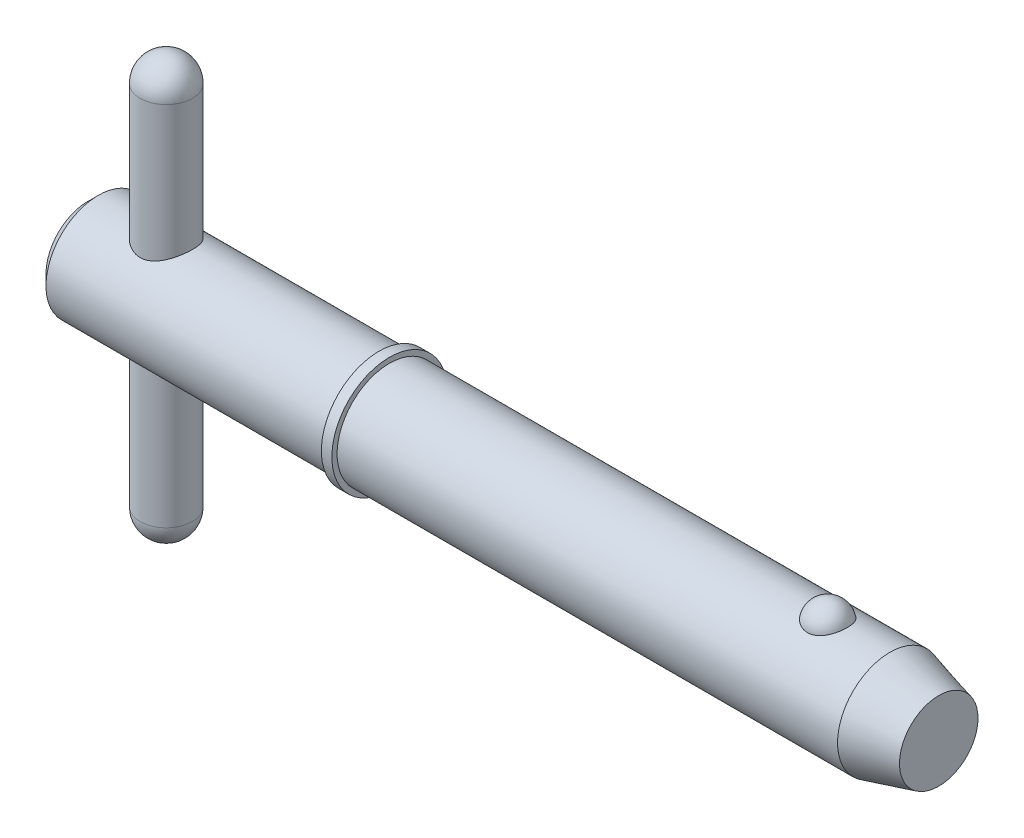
ISO-10303-21;
HEADER;
FILE_DESCRIPTION(('STEP AP214'),'2;1');
FILE_NAME('part.step','',(''),(''),'','','');
FILE_SCHEMA(('AUTOMOTIVE_DESIGN { 1 0 10303 214 1 1 1 1 }'));
ENDSEC;
DATA;
#1=APPLICATION_CONTEXT('core data for automotive mechanical design processes');
#2=APPLICATION_PROTOCOL_DEFINITION('international standard','automotive_design',2000,#1);
#3=PRODUCT_CONTEXT('',#1,'mechanical');
#4=PRODUCT('Part','Part','',(#3));
#5=PRODUCT_RELATED_PRODUCT_CATEGORY('part','',(#4));
#6=PRODUCT_DEFINITION_FORMATION('','',#4);
#7=PRODUCT_DEFINITION_CONTEXT('part definition',#1,'design');
#8=PRODUCT_DEFINITION('design','',#6,#7);
#9=PRODUCT_DEFINITION_SHAPE('','',#8);
#10=(LENGTH_UNIT() NAMED_UNIT(*) SI_UNIT(.MILLI.,.METRE.));
#11=(NAMED_UNIT(*) PLANE_ANGLE_UNIT() SI_UNIT($,.RADIAN.));
#12=(NAMED_UNIT(*) SI_UNIT($,.STERADIAN.) SOLID_ANGLE_UNIT());
#13=UNCERTAINTY_MEASURE_WITH_UNIT(LENGTH_MEASURE(1.E-05),#10,'distance_accuracy_value','');
#14=(GEOMETRIC_REPRESENTATION_CONTEXT(3) GLOBAL_UNCERTAINTY_ASSIGNED_CONTEXT((#13)) GLOBAL_UNIT_ASSIGNED_CONTEXT((#10,
#11,#12)) REPRESENTATION_CONTEXT('',''));
#15=CARTESIAN_POINT('',(0.,0.,0.));
#16=DIRECTION('',(0.,0.,1.));
#17=DIRECTION('',(1.,0.,0.));
#18=AXIS2_PLACEMENT_3D('',#15,#16,#17);
#19=CARTESIAN_POINT('',(4.755,12.7,0.));
#20=DIRECTION('',(0.,-1.,0.));
#21=DIRECTION('',(0.,0.,-1.));
#22=AXIS2_PLACEMENT_3D('',#19,#20,#21);
#23=CYLINDRICAL_SURFACE('',#22,1.585);
#24=CARTESIAN_POINT('',(4.755,-11.115,0.));
#25=DIRECTION('',(0.,-1.,0.));
#26=DIRECTION('',(0.,0.,-1.));
#27=AXIS2_PLACEMENT_3D('',#24,#25,#26);
#28=CIRCLE('',#27,1.585);
#29=CARTESIAN_POINT('',(4.755,-11.115,-1.585));
#30=VERTEX_POINT('',#29);
#31=EDGE_CURVE('P0_E10',#30,#30,#28,.F.);
#32=ORIENTED_EDGE('',*,*,#31,.T.);
#33=EDGE_LOOP('',(#32));
#34=FACE_BOUND('',#33,.T.);
#35=CARTESIAN_POINT('',(4.755,11.115,0.));
#36=DIRECTION('',(0.,-1.,0.));
#37=DIRECTION('',(0.,0.,-1.));
#38=AXIS2_PLACEMENT_3D('',#35,#36,#37);
#39=CIRCLE('',#38,1.585);
#40=CARTESIAN_POINT('',(4.755,11.115,-1.585));
#41=VERTEX_POINT('',#40);
#42=EDGE_CURVE('P0_E21',#41,#41,#39,.T.);
#43=ORIENTED_EDGE('',*,*,#42,.T.);
#44=EDGE_LOOP('',(#43));
#45=FACE_BOUND('',#44,.T.);
#46=ADVANCED_FACE('P0_F14',(#34,#45),#23,.T.);
#47=CARTESIAN_POINT('',(4.755,-11.115,0.));
#48=DIRECTION('',(0.,0.,1.));
#49=DIRECTION('',(1.,0.,0.));
#50=AXIS2_PLACEMENT_3D('',#47,#48,#49);
#51=SPHERICAL_SURFACE('',#50,1.585);
#52=CARTESIAN_POINT('',(4.755,-11.115,0.));
#53=DIRECTION('',(0.,-1.,0.));
#54=DIRECTION('',(0.,0.,-1.));
#55=AXIS2_PLACEMENT_3D('',#52,#53,#54);
#56=SPHERICAL_SURFACE('',#55,1.585);
#57=ORIENTED_EDGE('',*,*,#31,.F.);
#58=EDGE_LOOP('',(#57));
#59=FACE_BOUND('',#58,.T.);
#60=ADVANCED_FACE('P0_F29',(#59),#56,.T.);
#61=CARTESIAN_POINT('',(4.755,11.115,0.));
#62=DIRECTION('',(0.,0.,1.));
#63=DIRECTION('',(1.,0.,0.));
#64=AXIS2_PLACEMENT_3D('',#61,#62,#63);
#65=SPHERICAL_SURFACE('',#64,1.585);
#66=CARTESIAN_POINT('',(4.755,11.115,0.));
#67=DIRECTION('',(0.,-1.,0.));
#68=DIRECTION('',(0.,0.,-1.));
#69=AXIS2_PLACEMENT_3D('',#66,#67,#68);
#70=SPHERICAL_SURFACE('',#69,1.585);
#71=ORIENTED_EDGE('',*,*,#42,.F.);
#72=EDGE_LOOP('',(#71));
#73=FACE_BOUND('',#72,.T.);
#74=ADVANCED_FACE('P0_F16',(#73),#70,.T.);
#75=CLOSED_SHELL('',(#46,#60,#74));
#76=MANIFOLD_SOLID_BREP('P0_B1',#75);
#77=CARTESIAN_POINT('',(0.,0.,0.));
#78=DIRECTION('',(1.,0.,0.));
#79=DIRECTION('',(0.,0.,-1.));
#80=AXIS2_PLACEMENT_3D('',#77,#78,#79);
#81=CYLINDRICAL_SURFACE('',#80,3.175);
#82=CARTESIAN_POINT('',(48.6476846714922,0.,0.));
#83=DIRECTION('',(1.,0.,0.));
#84=DIRECTION('',(0.,0.,-1.));
#85=AXIS2_PLACEMENT_3D('',#82,#83,#84);
#86=CIRCLE('',#85,3.175);
#87=CARTESIAN_POINT('',(48.6476846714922,0.,-3.175));
#88=VERTEX_POINT('',#87);
#89=EDGE_CURVE('P1_E81',#88,#88,#86,.T.);
#90=ORIENTED_EDGE('',*,*,#89,.F.);
#91=EDGE_LOOP('',(#90));
#92=FACE_BOUND('',#91,.T.);
#93=CARTESIAN_POINT('',(18.29,0.,0.));
#94=DIRECTION('',(1.,0.,0.));
#95=DIRECTION('',(0.,0.,-1.));
#96=AXIS2_PLACEMENT_3D('',#93,#94,#95);
#97=CIRCLE('',#96,3.175);
#98=CARTESIAN_POINT('',(18.29,0.,-3.175));
#99=VERTEX_POINT('',#98);
#100=EDGE_CURVE('P1_E85',#99,#99,#97,.T.);
#101=ORIENTED_EDGE('',*,*,#100,.T.);
#102=EDGE_LOOP('',(#101));
#103=FACE_BOUND('',#102,.T.);
#104=CARTESIAN_POINT('',(44.8757276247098,2.92898950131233,1.2254164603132));
#105=CARTESIAN_POINT('',(44.812316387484,2.92899434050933,1.22541146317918));
#106=CARTESIAN_POINT('',(44.7487979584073,2.93112688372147,1.2203464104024));
#107=CARTESIAN_POINT('',(44.6235306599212,2.93942752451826,1.20020949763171));
#108=CARTESIAN_POINT('',(44.5617869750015,2.9456063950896,1.18511092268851));
#109=CARTESIAN_POINT('',(44.4420651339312,2.96127115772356,1.14540352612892));
#110=CARTESIAN_POINT('',(44.3840775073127,2.97074831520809,1.12081980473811));
#111=CARTESIAN_POINT('',(44.2731943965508,2.99197584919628,1.06285154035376));
#112=CARTESIAN_POINT('',(44.2202966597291,3.0037252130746,1.02947091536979));
#113=CARTESIAN_POINT('',(44.1192688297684,3.02865714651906,0.95367409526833));
#114=CARTESIAN_POINT('',(44.071324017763,3.04187163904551,0.911021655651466));
#115=CARTESIAN_POINT('',(43.9830360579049,3.06808741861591,0.818400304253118));
#116=CARTESIAN_POINT('',(43.9426952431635,3.08108863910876,0.768429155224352));
#117=CARTESIAN_POINT('',(43.8688039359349,3.10614903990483,0.6600648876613));
#118=CARTESIAN_POINT('',(43.8356330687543,3.11814104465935,0.601396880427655));
#119=CARTESIAN_POINT('',(43.7791190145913,3.13926931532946,0.479026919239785));
#120=CARTESIAN_POINT('',(43.7557764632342,3.14840539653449,0.415324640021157));
#121=CARTESIAN_POINT('',(43.7191785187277,3.16298160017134,0.283885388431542));
#122=CARTESIAN_POINT('',(43.7060407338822,3.16837855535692,0.216110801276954));
#123=CARTESIAN_POINT('',(43.6905676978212,3.17475386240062,0.0791367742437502));
#124=CARTESIAN_POINT('',(43.688232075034,3.17573236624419,0.00993738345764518));
#125=CARTESIAN_POINT('',(43.694388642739,3.17318075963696,-0.127420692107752));
#126=CARTESIAN_POINT('',(43.7028073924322,3.16968122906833,-0.195583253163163));
#127=CARTESIAN_POINT('',(43.7301752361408,3.1585790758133,-0.329413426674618));
#128=CARTESIAN_POINT('',(43.7491245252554,3.15097637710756,-0.395080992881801));
#129=CARTESIAN_POINT('',(43.7972057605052,3.13242485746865,-0.522180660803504));
#130=CARTESIAN_POINT('',(43.8263524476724,3.12147119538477,-0.583606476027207));
#131=CARTESIAN_POINT('',(43.8942352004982,3.09734973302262,-0.700436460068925));
#132=CARTESIAN_POINT('',(43.932972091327,3.08418174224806,-0.7558401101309));
#133=CARTESIAN_POINT('',(44.0194771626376,3.05694884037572,-0.859404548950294));
#134=CARTESIAN_POINT('',(44.0672961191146,3.04287919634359,-0.907521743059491));
#135=CARTESIAN_POINT('',(44.1707353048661,3.01548927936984,-0.994758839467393));
#136=CARTESIAN_POINT('',(44.2263549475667,3.00216895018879,-1.03387941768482));
#137=CARTESIAN_POINT('',(44.3428093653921,2.97810316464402,-1.10126594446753));
#138=CARTESIAN_POINT('',(44.4035182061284,2.96731170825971,-1.12973256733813));
#139=CARTESIAN_POINT('',(44.5293712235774,2.9492893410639,-1.17598467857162));
#140=CARTESIAN_POINT('',(44.5945137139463,2.94205708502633,-1.19377420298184));
#141=CARTESIAN_POINT('',(44.7238562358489,2.93233065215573,-1.21746387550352));
#142=CARTESIAN_POINT('',(44.7879385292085,2.92961621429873,-1.22391763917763));
#143=CARTESIAN_POINT('',(44.9163375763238,2.92855752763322,-1.22644976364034));
#144=CARTESIAN_POINT('',(44.980654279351,2.93021238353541,-1.22253024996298));
#145=CARTESIAN_POINT('',(45.1055239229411,2.9375685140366,-1.20474140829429));
#146=CARTESIAN_POINT('',(45.166131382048,2.94313790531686,-1.19119621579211));
#147=CARTESIAN_POINT('',(45.2841106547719,2.95756226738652,-1.15491492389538));
#148=CARTESIAN_POINT('',(45.3414822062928,2.96641750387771,-1.13217808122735));
#149=CARTESIAN_POINT('',(45.4527699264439,2.98669918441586,-1.07755083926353));
#150=CARTESIAN_POINT('',(45.5065845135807,2.9981771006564,-1.0454730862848));
#151=CARTESIAN_POINT('',(45.6081473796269,3.02240235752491,-0.973220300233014));
#152=CARTESIAN_POINT('',(45.6558942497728,3.03514999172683,-0.933043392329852));
#153=CARTESIAN_POINT('',(45.7465817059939,3.06131230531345,-0.843372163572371));
#154=CARTESIAN_POINT('',(45.7891588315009,3.07472822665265,-0.793510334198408));
#155=CARTESIAN_POINT('',(45.8656765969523,3.10021106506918,-0.687241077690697));
#156=CARTESIAN_POINT('',(45.8996156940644,3.1122777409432,-0.630832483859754));
#157=CARTESIAN_POINT('',(45.9591209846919,3.134208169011,-0.511059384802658));
#158=CARTESIAN_POINT('',(45.9843892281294,3.14399040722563,-0.447531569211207));
#159=CARTESIAN_POINT('',(46.0245117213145,3.15983820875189,-0.316827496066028));
#160=CARTESIAN_POINT('',(46.0393659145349,3.16590375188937,-0.249651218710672));
#161=CARTESIAN_POINT('',(46.058358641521,3.17370076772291,-0.11354918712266));
#162=CARTESIAN_POINT('',(46.0624966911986,3.17543204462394,-0.0446233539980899));
#163=CARTESIAN_POINT('',(46.0599697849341,3.17438372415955,0.0929938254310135));
#164=CARTESIAN_POINT('',(46.0533050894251,3.17160423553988,0.161685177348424));
#165=CARTESIAN_POINT('',(46.0293754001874,3.1618438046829,0.296502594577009));
#166=CARTESIAN_POINT('',(46.0121674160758,3.15488546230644,0.362640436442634));
#167=CARTESIAN_POINT('',(45.967547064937,3.13748892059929,0.490896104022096));
#168=CARTESIAN_POINT('',(45.9401339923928,3.12705048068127,0.553013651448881));
#169=CARTESIAN_POINT('',(45.8754626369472,3.10369139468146,0.671876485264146));
#170=CARTESIAN_POINT('',(45.8381467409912,3.0907563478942,0.728587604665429));
#171=CARTESIAN_POINT('',(45.7545246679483,3.06381731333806,0.834653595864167));
#172=CARTESIAN_POINT('',(45.7082189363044,3.04981337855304,0.884008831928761));
#173=CARTESIAN_POINT('',(45.6077184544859,3.02230423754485,0.973916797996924));
#174=CARTESIAN_POINT('',(45.553535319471,3.00879833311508,1.01448227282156));
#175=CARTESIAN_POINT('',(45.4385299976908,2.98383625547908,1.0857155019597));
#176=CARTESIAN_POINT('',(45.3777053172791,2.9723808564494,1.11637952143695));
#177=CARTESIAN_POINT('',(45.2533690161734,2.95329063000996,1.16592590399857));
#178=CARTESIAN_POINT('',(45.1900230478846,2.9455373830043,1.18517901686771));
#179=CARTESIAN_POINT('',(45.0607664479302,2.9342556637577,1.21284802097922));
#180=CARTESIAN_POINT('',(44.9948641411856,2.93071450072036,1.2212964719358));
#181=CARTESIAN_POINT('',(44.911116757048,2.9291525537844,1.22502505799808));
#182=CARTESIAN_POINT('',(44.8934263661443,2.92898815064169,1.22541785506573));
#183=CARTESIAN_POINT('',(44.8757276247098,2.92898950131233,1.2254164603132));
#184=B_SPLINE_CURVE_WITH_KNOTS('',3,(#104,#105,#106,#107,#108,#109,#110,#111,#112,#113,#114,
#115,#116,#117,#118,#119,#120,#121,#122,#123,#124,#125,#126,#127,#128,#129,#130,#131,#132,#133,
#134,#135,#136,#137,#138,#139,#140,#141,#142,#143,#144,#145,#146,#147,#148,#149,#150,#151,#152,
#153,#154,#155,#156,#157,#158,#159,#160,#161,#162,#163,#164,#165,#166,#167,#168,#169,#170,#171,
#172,#173,#174,#175,#176,#177,#178,#179,#180,#181,#182,#183),.UNSPECIFIED.,.T.,.F.,(4,2,2,2,2,2,
2,2,2,2,2,2,2,2,2,2,2,2,2,2,2,2,2,2,2,2,2,2,2,2,2,2,2,2,2,2,2,2,2,4),(0.,0.190186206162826,
0.380880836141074,0.571074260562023,0.761183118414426,0.956866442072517,1.15260970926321,
1.35701770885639,1.56143892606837,1.76818248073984,1.97491892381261,2.18025109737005,
2.38558707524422,2.59122111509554,2.79687285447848,3.00371012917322,3.2105318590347,
3.41323429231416,3.61586005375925,3.80828192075,4.00066436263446,4.18685798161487,
4.37306665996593,4.56330302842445,4.75358348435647,4.95345287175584,5.15335793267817,
5.35957003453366,5.56578325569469,5.77200579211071,5.97822335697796,6.183335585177,
6.38846199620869,6.59480900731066,6.80114579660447,7.00718137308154,7.21329457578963,
7.41228022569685,7.61066481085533,7.66374777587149),.UNSPECIFIED.);
#185=CARTESIAN_POINT('',(44.8757276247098,2.92898950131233,1.2254164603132));
#186=VERTEX_POINT('',#185);
#187=EDGE_CURVE('P1_E35',#186,#186,#184,.T.);
#188=ORIENTED_EDGE('',*,*,#187,.T.);
#189=EDGE_LOOP('',(#188));
#190=FACE_BOUND('',#189,.T.);
#191=ADVANCED_FACE('P1_F13',(#92,#103,#190),#81,.T.);
#192=CARTESIAN_POINT('',(0.,0.,0.));
#193=DIRECTION('',(-1.,0.,0.));
#194=DIRECTION('',(0.,0.,1.));
#195=AXIS2_PLACEMENT_3D('',#192,#193,#194);
#196=PLANE('',#195);
#197=CARTESIAN_POINT('',(0.,0.,0.));
#198=DIRECTION('',(1.,0.,0.));
#199=DIRECTION('',(0.,0.,-1.));
#200=AXIS2_PLACEMENT_3D('',#197,#198,#199);
#201=CIRCLE('',#200,2.54);
#202=CARTESIAN_POINT('',(0.,0.,-2.54));
#203=VERTEX_POINT('',#202);
#204=EDGE_CURVE('P1_E9',#203,#203,#201,.T.);
#205=ORIENTED_EDGE('',*,*,#204,.F.);
#206=EDGE_LOOP('',(#205));
#207=FACE_BOUND('',#206,.T.);
#208=ADVANCED_FACE('P1_F15',(#207),#196,.T.);
#209=CARTESIAN_POINT('',(0.634999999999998,0.,0.));
#210=DIRECTION('',(1.,0.,0.));
#211=DIRECTION('',(0.,0.,-1.));
#212=AXIS2_PLACEMENT_3D('',#209,#210,#211);
#213=CONICAL_SURFACE('',#212,3.175,0.78539816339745);
#214=ORIENTED_EDGE('',*,*,#204,.T.);
#215=EDGE_LOOP('',(#214));
#216=FACE_BOUND('',#215,.T.);
#217=CARTESIAN_POINT('',(0.634999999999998,0.,0.));
#218=DIRECTION('',(1.,0.,0.));
#219=DIRECTION('',(0.,0.,-1.));
#220=AXIS2_PLACEMENT_3D('',#217,#218,#219);
#221=CIRCLE('',#220,3.175);
#222=CARTESIAN_POINT('',(0.634999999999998,0.,-3.175));
#223=VERTEX_POINT('',#222);
#224=EDGE_CURVE('P1_E26',#223,#223,#221,.T.);
#225=ORIENTED_EDGE('',*,*,#224,.F.);
#226=EDGE_LOOP('',(#225));
#227=FACE_BOUND('',#226,.T.);
#228=ADVANCED_FACE('P1_F77',(#216,#227),#213,.T.);
#229=CARTESIAN_POINT('',(0.,0.,0.));
#230=DIRECTION('',(1.,0.,0.));
#231=DIRECTION('',(0.,0.,-1.));
#232=AXIS2_PLACEMENT_3D('',#229,#230,#231);
#233=CYLINDRICAL_SURFACE('',#232,3.175);
#234=CARTESIAN_POINT('',(4.755,-2.75107251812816,1.585));
#235=CARTESIAN_POINT('',(4.67238891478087,-2.7510796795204,1.58499425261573));
#236=CARTESIAN_POINT('',(4.58967306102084,-2.75485010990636,1.57849830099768));
#237=CARTESIAN_POINT('',(4.42677850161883,-2.76938647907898,1.55284486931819));
#238=CARTESIAN_POINT('',(4.34660551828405,-2.78016716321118,1.53366069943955));
#239=CARTESIAN_POINT('',(4.19146029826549,-2.80716278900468,1.48366329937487));
#240=CARTESIAN_POINT('',(4.11646293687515,-2.8233488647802,1.45291173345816));
#241=CARTESIAN_POINT('',(3.97271079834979,-2.85928672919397,1.38084067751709));
#242=CARTESIAN_POINT('',(3.90395634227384,-2.87903870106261,1.33952064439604));
#243=CARTESIAN_POINT('',(3.76839976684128,-2.921867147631,1.24350234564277));
#244=CARTESIAN_POINT('',(3.702222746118,-2.94508343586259,1.18798355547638));
#245=CARTESIAN_POINT('',(3.5796334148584,-2.99109588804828,1.06685014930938));
#246=CARTESIAN_POINT('',(3.52322596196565,-3.01389183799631,1.00123054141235));
#247=CARTESIAN_POINT('',(3.41807024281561,-3.05832598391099,0.856373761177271));
#248=CARTESIAN_POINT('',(3.37009053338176,-3.07978367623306,0.776518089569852));
#249=CARTESIAN_POINT('',(3.28853137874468,-3.11730894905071,0.608596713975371));
#250=CARTESIAN_POINT('',(3.25494287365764,-3.1333799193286,0.520536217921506));
#251=CARTESIAN_POINT('',(3.20559401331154,-3.15731341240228,0.345327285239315));
#252=CARTESIAN_POINT('',(3.18873760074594,-3.16567752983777,0.258557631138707));
#253=CARTESIAN_POINT('',(3.16972238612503,-3.17512718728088,0.0830496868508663));
#254=CARTESIAN_POINT('',(3.16755472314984,-3.17621711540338,-0.00568738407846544));
#255=CARTESIAN_POINT('',(3.1775542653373,-3.17123385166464,-0.174372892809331));
#256=CARTESIAN_POINT('',(3.18849502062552,-3.16577346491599,-0.254416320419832));
#257=CARTESIAN_POINT('',(3.22220680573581,-3.14922844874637,-0.411354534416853));
#258=CARTESIAN_POINT('',(3.2449787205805,-3.13814339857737,-0.488249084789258));
#259=CARTESIAN_POINT('',(3.30185558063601,-3.111172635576,-0.638050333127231));
#260=CARTESIAN_POINT('',(3.33611332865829,-3.09522247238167,-0.710886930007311));
#261=CARTESIAN_POINT('',(3.41477890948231,-3.05996035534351,-0.849953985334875));
#262=CARTESIAN_POINT('',(3.45919037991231,-3.04064719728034,-0.916182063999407));
#263=CARTESIAN_POINT('',(3.5617148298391,-2.99832415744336,-1.04681642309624));
#264=CARTESIAN_POINT('',(3.62072497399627,-2.97513741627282,-1.11046186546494));
#265=CARTESIAN_POINT('',(3.7483697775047,-2.92885066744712,-1.22736291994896));
#266=CARTESIAN_POINT('',(3.81701173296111,-2.90575073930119,-1.2806105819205));
#267=CARTESIAN_POINT('',(3.96727993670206,-2.86067370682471,-1.37849835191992));
#268=CARTESIAN_POINT('',(4.04945242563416,-2.83885964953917,-1.42238246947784));
#269=CARTESIAN_POINT('',(4.2213558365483,-2.80110454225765,-1.49537418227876));
#270=CARTESIAN_POINT('',(4.3110787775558,-2.78515738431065,-1.52449715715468));
#271=CARTESIAN_POINT('',(4.48806324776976,-2.76271292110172,-1.56478065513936));
#272=CARTESIAN_POINT('',(4.57495732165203,-2.75556745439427,-1.57718067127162));
#273=CARTESIAN_POINT('',(4.74985771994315,-2.74969306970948,-1.58740564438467));
#274=CARTESIAN_POINT('',(4.8378632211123,-2.75095824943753,-1.58524082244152));
#275=CARTESIAN_POINT('',(5.00227282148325,-2.76107477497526,-1.56753530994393));
#276=CARTESIAN_POINT('',(5.07889680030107,-2.76908515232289,-1.55347662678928));
#277=CARTESIAN_POINT('',(5.22855309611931,-2.79054849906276,-1.51458035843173));
#278=CARTESIAN_POINT('',(5.30158424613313,-2.80400322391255,-1.489739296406));
#279=CARTESIAN_POINT('',(5.44583114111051,-2.83556995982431,-1.42877335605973));
#280=CARTESIAN_POINT('',(5.51680600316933,-2.85386886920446,-1.39217900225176));
#281=CARTESIAN_POINT('',(5.6520174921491,-2.89289503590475,-1.30915485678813));
#282=CARTESIAN_POINT('',(5.71625063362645,-2.91362353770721,-1.26272001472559));
#283=CARTESIAN_POINT('',(5.8445938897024,-2.95830220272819,-1.15451693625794));
#284=CARTESIAN_POINT('',(5.90767560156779,-2.98233004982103,-1.09155543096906));
#285=CARTESIAN_POINT('',(6.0226995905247,-3.02864458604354,-0.955560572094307));
#286=CARTESIAN_POINT('',(6.07463814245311,-3.05093069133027,-0.882523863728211));
#287=CARTESIAN_POINT('',(6.16704288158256,-3.09200671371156,-0.725836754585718));
#288=CARTESIAN_POINT('',(6.20717458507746,-3.11069030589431,-0.64195924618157));
#289=CARTESIAN_POINT('',(6.27235859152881,-3.1416474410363,-0.467442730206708));
#290=CARTESIAN_POINT('',(6.29742409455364,-3.15392659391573,-0.376809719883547));
#291=CARTESIAN_POINT('',(6.32960989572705,-3.16979844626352,-0.200314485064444));
#292=CARTESIAN_POINT('',(6.33816324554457,-3.17408359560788,-0.114775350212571));
#293=CARTESIAN_POINT('',(6.34130309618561,-3.17565001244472,0.0566108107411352));
#294=CARTESIAN_POINT('',(6.33589445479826,-3.17293371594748,0.142457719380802));
#295=CARTESIAN_POINT('',(6.31221457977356,-3.16120608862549,0.306097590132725));
#296=CARTESIAN_POINT('',(6.2948097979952,-3.15261910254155,0.38404960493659));
#297=CARTESIAN_POINT('',(6.24879775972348,-3.13040364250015,0.535801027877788));
#298=CARTESIAN_POINT('',(6.22018889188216,-3.11677444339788,0.609599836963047));
#299=CARTESIAN_POINT('',(6.15130303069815,-3.08497808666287,0.754502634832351));
#300=CARTESIAN_POINT('',(6.11057850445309,-3.0666414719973,0.82535556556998));
#301=CARTESIAN_POINT('',(6.01917980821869,-3.02735012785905,0.95951596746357));
#302=CARTESIAN_POINT('',(5.96850106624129,-3.00639419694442,1.02281994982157));
#303=CARTESIAN_POINT('',(5.8528006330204,-2.96149402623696,1.1467073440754));
#304=CARTESIAN_POINT('',(5.78685463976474,-2.93745961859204,1.20639723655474));
#305=CARTESIAN_POINT('',(5.64552278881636,-2.89084502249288,1.31419099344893));
#306=CARTESIAN_POINT('',(5.57012871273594,-2.8682661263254,1.36228466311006));
#307=CARTESIAN_POINT('',(5.40892145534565,-2.82661780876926,1.44677201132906));
#308=CARTESIAN_POINT('',(5.32285703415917,-2.80767948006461,1.48275497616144));
#309=CARTESIAN_POINT('',(5.14469010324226,-2.77716572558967,1.53916557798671));
#310=CARTESIAN_POINT('',(5.05260892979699,-2.76556569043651,1.55964525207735));
#311=CARTESIAN_POINT('',(4.92544162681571,-2.75613775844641,1.57618070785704));
#312=CARTESIAN_POINT('',(4.89147210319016,-2.75424493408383,1.57948285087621));
#313=CARTESIAN_POINT('',(4.82334103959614,-2.75171079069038,1.58389375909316));
#314=CARTESIAN_POINT('',(4.78917948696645,-2.75106955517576,1.58500237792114));
#315=CARTESIAN_POINT('',(4.755,-2.75107251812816,1.585));
#316=B_SPLINE_CURVE_WITH_KNOTS('',3,(#234,#235,#236,#237,#238,#239,#240,#241,#242,#243,#244,
#245,#246,#247,#248,#249,#250,#251,#252,#253,#254,#255,#256,#257,#258,#259,#260,#261,#262,#263,
#264,#265,#266,#267,#268,#269,#270,#271,#272,#273,#274,#275,#276,#277,#278,#279,#280,#281,#282,
#283,#284,#285,#286,#287,#288,#289,#290,#291,#292,#293,#294,#295,#296,#297,#298,#299,#300,#301,
#302,#303,#304,#305,#306,#307,#308,#309,#310,#311,#312,#313,#314,#315),.UNSPECIFIED.,.T.,.F.,(4,
2,2,2,2,2,2,2,2,2,2,2,2,2,2,2,2,2,2,2,2,2,2,2,2,2,2,2,2,2,2,2,2,2,2,2,2,2,2,2,4),(0.,
0.247689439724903,0.495901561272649,0.742808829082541,0.989728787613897,1.25694656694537,
1.52429683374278,1.80959781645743,2.0947189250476,2.35960564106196,2.62433255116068,
2.86610932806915,3.1079041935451,3.35305262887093,3.59828902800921,3.86665310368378,
4.13522157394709,4.4207514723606,4.70598326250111,4.9686344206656,5.23110127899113,
5.46499114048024,5.69895647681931,5.94376186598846,6.1886932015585,6.46438263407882,
6.74016408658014,7.0231370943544,7.30586181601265,7.5626977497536,7.81944433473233,
8.05935987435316,8.29930993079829,8.54954401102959,8.79989329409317,9.07508848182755,
9.35052473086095,9.63453318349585,9.91758407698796,10.0200561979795,10.1225351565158),.UNSPECIFIED.);
#317=CARTESIAN_POINT('',(4.755,-2.75107251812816,1.585));
#318=VERTEX_POINT('',#317);
#319=EDGE_CURVE('P1_E17',#318,#318,#316,.T.);
#320=ORIENTED_EDGE('',*,*,#319,.F.);
#321=EDGE_LOOP('',(#320));
#322=FACE_BOUND('',#321,.T.);
#323=CARTESIAN_POINT('',(4.755,2.75107251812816,1.585));
#324=CARTESIAN_POINT('',(4.83761108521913,2.7510796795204,1.58499425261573));
#325=CARTESIAN_POINT('',(4.92032693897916,2.75485010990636,1.57849830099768));
#326=CARTESIAN_POINT('',(5.08322149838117,2.76938647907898,1.55284486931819));
#327=CARTESIAN_POINT('',(5.16339448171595,2.78016716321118,1.53366069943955));
#328=CARTESIAN_POINT('',(5.31853970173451,2.80716278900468,1.48366329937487));
#329=CARTESIAN_POINT('',(5.39353706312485,2.8233488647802,1.45291173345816));
#330=CARTESIAN_POINT('',(5.53728920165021,2.85928672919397,1.38084067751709));
#331=CARTESIAN_POINT('',(5.60604365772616,2.87903870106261,1.33952064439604));
#332=CARTESIAN_POINT('',(5.74160023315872,2.921867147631,1.24350234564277));
#333=CARTESIAN_POINT('',(5.807777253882,2.94508343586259,1.18798355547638));
#334=CARTESIAN_POINT('',(5.9303665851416,2.99109588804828,1.06685014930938));
#335=CARTESIAN_POINT('',(5.98677403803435,3.01389183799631,1.00123054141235));
#336=CARTESIAN_POINT('',(6.09192975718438,3.05832598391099,0.85637376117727));
#337=CARTESIAN_POINT('',(6.13990946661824,3.07978367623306,0.776518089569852));
#338=CARTESIAN_POINT('',(6.22146862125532,3.11730894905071,0.608596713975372));
#339=CARTESIAN_POINT('',(6.25505712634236,3.1333799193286,0.520536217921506));
#340=CARTESIAN_POINT('',(6.30440598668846,3.15731341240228,0.345327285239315));
#341=CARTESIAN_POINT('',(6.32126239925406,3.16567752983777,0.258557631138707));
#342=CARTESIAN_POINT('',(6.34027761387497,3.17512718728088,0.0830496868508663));
#343=CARTESIAN_POINT('',(6.34244527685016,3.17621711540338,-0.00568738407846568));
#344=CARTESIAN_POINT('',(6.3324457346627,3.17123385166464,-0.174372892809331));
#345=CARTESIAN_POINT('',(6.32150497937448,3.16577346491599,-0.254416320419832));
#346=CARTESIAN_POINT('',(6.28779319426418,3.14922844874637,-0.411354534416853));
#347=CARTESIAN_POINT('',(6.2650212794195,3.13814339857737,-0.488249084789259));
#348=CARTESIAN_POINT('',(6.20814441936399,3.111172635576,-0.638050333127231));
#349=CARTESIAN_POINT('',(6.17388667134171,3.09522247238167,-0.710886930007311));
#350=CARTESIAN_POINT('',(6.09522109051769,3.05996035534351,-0.849953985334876));
#351=CARTESIAN_POINT('',(6.05080962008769,3.04064719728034,-0.916182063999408));
#352=CARTESIAN_POINT('',(5.9482851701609,2.99832415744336,-1.04681642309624));
#353=CARTESIAN_POINT('',(5.88927502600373,2.97513741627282,-1.11046186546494));
#354=CARTESIAN_POINT('',(5.7616302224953,2.92885066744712,-1.22736291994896));
#355=CARTESIAN_POINT('',(5.69298826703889,2.90575073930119,-1.2806105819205));
#356=CARTESIAN_POINT('',(5.54272006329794,2.86067370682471,-1.37849835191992));
#357=CARTESIAN_POINT('',(5.46054757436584,2.83885964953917,-1.42238246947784));
#358=CARTESIAN_POINT('',(5.2886441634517,2.80110454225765,-1.49537418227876));
#359=CARTESIAN_POINT('',(5.19892122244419,2.78515738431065,-1.52449715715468));
#360=CARTESIAN_POINT('',(5.02193675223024,2.76271292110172,-1.56478065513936));
#361=CARTESIAN_POINT('',(4.93504267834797,2.75556745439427,-1.57718067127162));
#362=CARTESIAN_POINT('',(4.76014228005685,2.74969306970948,-1.58740564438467));
#363=CARTESIAN_POINT('',(4.6721367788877,2.75095824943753,-1.58524082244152));
#364=CARTESIAN_POINT('',(4.50772717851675,2.76107477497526,-1.56753530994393));
#365=CARTESIAN_POINT('',(4.43110319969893,2.76908515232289,-1.55347662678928));
#366=CARTESIAN_POINT('',(4.28144690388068,2.79054849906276,-1.51458035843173));
#367=CARTESIAN_POINT('',(4.20841575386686,2.80400322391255,-1.489739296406));
#368=CARTESIAN_POINT('',(4.06416885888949,2.83556995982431,-1.42877335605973));
#369=CARTESIAN_POINT('',(3.99319399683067,2.85386886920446,-1.39217900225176));
#370=CARTESIAN_POINT('',(3.8579825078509,2.89289503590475,-1.30915485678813));
#371=CARTESIAN_POINT('',(3.79374936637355,2.91362353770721,-1.26272001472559));
#372=CARTESIAN_POINT('',(3.6654061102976,2.95830220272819,-1.15451693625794));
#373=CARTESIAN_POINT('',(3.60232439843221,2.98233004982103,-1.09155543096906));
#374=CARTESIAN_POINT('',(3.4873004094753,3.02864458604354,-0.955560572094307));
#375=CARTESIAN_POINT('',(3.43536185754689,3.05093069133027,-0.88252386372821));
#376=CARTESIAN_POINT('',(3.34295711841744,3.09200671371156,-0.725836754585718));
#377=CARTESIAN_POINT('',(3.30282541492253,3.11069030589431,-0.64195924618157));
#378=CARTESIAN_POINT('',(3.23764140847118,3.14164744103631,-0.467442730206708));
#379=CARTESIAN_POINT('',(3.21257590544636,3.15392659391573,-0.376809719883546));
#380=CARTESIAN_POINT('',(3.18039010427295,3.16979844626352,-0.200314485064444));
#381=CARTESIAN_POINT('',(3.17183675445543,3.17408359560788,-0.114775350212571));
#382=CARTESIAN_POINT('',(3.16869690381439,3.17565001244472,0.0566108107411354));
#383=CARTESIAN_POINT('',(3.17410554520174,3.17293371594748,0.142457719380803));
#384=CARTESIAN_POINT('',(3.19778542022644,3.16120608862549,0.306097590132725));
#385=CARTESIAN_POINT('',(3.2151902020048,3.15261910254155,0.384049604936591));
#386=CARTESIAN_POINT('',(3.26120224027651,3.13040364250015,0.535801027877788));
#387=CARTESIAN_POINT('',(3.28981110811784,3.11677444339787,0.609599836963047));
#388=CARTESIAN_POINT('',(3.35869696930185,3.08497808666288,0.754502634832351));
#389=CARTESIAN_POINT('',(3.39942149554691,3.0666414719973,0.82535556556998));
#390=CARTESIAN_POINT('',(3.49082019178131,3.02735012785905,0.95951596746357));
#391=CARTESIAN_POINT('',(3.54149893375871,3.00639419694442,1.02281994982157));
#392=CARTESIAN_POINT('',(3.6571993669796,2.96149402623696,1.1467073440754));
#393=CARTESIAN_POINT('',(3.72314536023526,2.93745961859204,1.20639723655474));
#394=CARTESIAN_POINT('',(3.86447721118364,2.89084502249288,1.31419099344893));
#395=CARTESIAN_POINT('',(3.93987128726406,2.8682661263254,1.36228466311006));
#396=CARTESIAN_POINT('',(4.10107854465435,2.82661780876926,1.44677201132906));
#397=CARTESIAN_POINT('',(4.18714296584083,2.80767948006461,1.48275497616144));
#398=CARTESIAN_POINT('',(4.36530989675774,2.77716572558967,1.53916557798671));
#399=CARTESIAN_POINT('',(4.45739107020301,2.76556569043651,1.55964525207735));
#400=CARTESIAN_POINT('',(4.58455837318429,2.75613775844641,1.57618070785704));
#401=CARTESIAN_POINT('',(4.61852789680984,2.75424493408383,1.57948285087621));
#402=CARTESIAN_POINT('',(4.68665896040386,2.75171079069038,1.58389375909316));
#403=CARTESIAN_POINT('',(4.72082051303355,2.75106955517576,1.58500237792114));
#404=CARTESIAN_POINT('',(4.755,2.75107251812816,1.585));
#405=B_SPLINE_CURVE_WITH_KNOTS('',3,(#323,#324,#325,#326,#327,#328,#329,#330,#331,#332,#333,
#334,#335,#336,#337,#338,#339,#340,#341,#342,#343,#344,#345,#346,#347,#348,#349,#350,#351,#352,
#353,#354,#355,#356,#357,#358,#359,#360,#361,#362,#363,#364,#365,#366,#367,#368,#369,#370,#371,
#372,#373,#374,#375,#376,#377,#378,#379,#380,#381,#382,#383,#384,#385,#386,#387,#388,#389,#390,
#391,#392,#393,#394,#395,#396,#397,#398,#399,#400,#401,#402,#403,#404),.UNSPECIFIED.,.T.,.F.,(4,
2,2,2,2,2,2,2,2,2,2,2,2,2,2,2,2,2,2,2,2,2,2,2,2,2,2,2,2,2,2,2,2,2,2,2,2,2,2,2,4),(0.,
0.247689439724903,0.495901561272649,0.742808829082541,0.989728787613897,1.25694656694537,
1.52429683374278,1.80959781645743,2.0947189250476,2.35960564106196,2.62433255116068,
2.86610932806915,3.1079041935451,3.35305262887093,3.59828902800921,3.86665310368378,
4.13522157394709,4.4207514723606,4.70598326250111,4.9686344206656,5.23110127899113,
5.46499114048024,5.69895647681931,5.94376186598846,6.1886932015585,6.46438263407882,
6.74016408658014,7.0231370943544,7.30586181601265,7.5626977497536,7.81944433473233,
8.05935987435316,8.29930993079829,8.54954401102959,8.79989329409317,9.07508848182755,
9.35052473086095,9.63453318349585,9.91758407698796,10.0200561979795,10.1225351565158),.UNSPECIFIED.);
#406=CARTESIAN_POINT('',(4.755,2.75107251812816,1.585));
#407=VERTEX_POINT('',#406);
#408=EDGE_CURVE('P1_E43',#407,#407,#405,.T.);
#409=ORIENTED_EDGE('',*,*,#408,.F.);
#410=EDGE_LOOP('',(#409));
#411=FACE_BOUND('',#410,.T.);
#412=ORIENTED_EDGE('',*,*,#224,.T.);
#413=EDGE_LOOP('',(#412));
#414=FACE_BOUND('',#413,.T.);
#415=CARTESIAN_POINT('',(17.655,0.,0.));
#416=DIRECTION('',(1.,0.,0.));
#417=DIRECTION('',(0.,0.,-1.));
#418=AXIS2_PLACEMENT_3D('',#415,#416,#417);
#419=CIRCLE('',#418,3.175);
#420=CARTESIAN_POINT('',(17.655,0.,-3.175));
#421=VERTEX_POINT('',#420);
#422=EDGE_CURVE('P1_E31',#421,#421,#419,.T.);
#423=ORIENTED_EDGE('',*,*,#422,.F.);
#424=EDGE_LOOP('',(#423));
#425=FACE_BOUND('',#424,.T.);
#426=ADVANCED_FACE('P1_F103',(#322,#411,#414,#425),#233,.T.);
#427=CARTESIAN_POINT('',(17.655,3.175,0.));
#428=DIRECTION('',(-1.,0.,0.));
#429=DIRECTION('',(0.,0.,1.));
#430=AXIS2_PLACEMENT_3D('',#427,#428,#429);
#431=PLANE('',#430);
#432=ORIENTED_EDGE('',*,*,#422,.T.);
#433=EDGE_LOOP('',(#432));
#434=FACE_BOUND('',#433,.T.);
#435=CARTESIAN_POINT('',(17.655,0.,0.));
#436=DIRECTION('',(1.,0.,0.));
#437=DIRECTION('',(0.,0.,-1.));
#438=AXIS2_PLACEMENT_3D('',#435,#436,#437);
#439=CIRCLE('',#438,3.4925);
#440=CARTESIAN_POINT('',(17.655,0.,-3.4925));
#441=VERTEX_POINT('',#440);
#442=EDGE_CURVE('P1_E91',#441,#441,#439,.T.);
#443=ORIENTED_EDGE('',*,*,#442,.F.);
#444=EDGE_LOOP('',(#443));
#445=FACE_BOUND('',#444,.T.);
#446=ADVANCED_FACE('P1_F100',(#434,#445),#431,.T.);
#447=CARTESIAN_POINT('',(0.,0.,0.));
#448=DIRECTION('',(1.,0.,0.));
#449=DIRECTION('',(0.,0.,-1.));
#450=AXIS2_PLACEMENT_3D('',#447,#448,#449);
#451=CYLINDRICAL_SURFACE('',#450,3.4925);
#452=ORIENTED_EDGE('',*,*,#442,.T.);
#453=EDGE_LOOP('',(#452));
#454=FACE_BOUND('',#453,.T.);
#455=CARTESIAN_POINT('',(18.29,0.,0.));
#456=DIRECTION('',(1.,0.,0.));
#457=DIRECTION('',(0.,0.,-1.));
#458=AXIS2_PLACEMENT_3D('',#455,#456,#457);
#459=CIRCLE('',#458,3.4925);
#460=CARTESIAN_POINT('',(18.29,0.,-3.4925));
#461=VERTEX_POINT('',#460);
#462=EDGE_CURVE('P1_E88',#461,#461,#459,.T.);
#463=ORIENTED_EDGE('',*,*,#462,.F.);
#464=EDGE_LOOP('',(#463));
#465=FACE_BOUND('',#464,.T.);
#466=ADVANCED_FACE('P1_F68',(#454,#465),#451,.T.);
#467=CARTESIAN_POINT('',(18.29,3.4925,0.));
#468=DIRECTION('',(1.,0.,0.));
#469=DIRECTION('',(0.,0.,-1.));
#470=AXIS2_PLACEMENT_3D('',#467,#468,#469);
#471=PLANE('',#470);
#472=ORIENTED_EDGE('',*,*,#462,.T.);
#473=EDGE_LOOP('',(#472));
#474=FACE_BOUND('',#473,.T.);
#475=ORIENTED_EDGE('',*,*,#100,.F.);
#476=EDGE_LOOP('',(#475));
#477=FACE_BOUND('',#476,.T.);
#478=ADVANCED_FACE('P1_F62',(#474,#477),#471,.T.);
#479=CARTESIAN_POINT('',(51.61,0.,0.));
#480=DIRECTION('',(-1.,0.,0.));
#481=DIRECTION('',(0.,0.,1.));
#482=AXIS2_PLACEMENT_3D('',#479,#480,#481);
#483=CONICAL_SURFACE('',#482,2.38125000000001,0.26179938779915);
#484=ORIENTED_EDGE('',*,*,#89,.T.);
#485=EDGE_LOOP('',(#484));
#486=FACE_BOUND('',#485,.T.);
#487=CARTESIAN_POINT('',(51.61,0.,0.));
#488=DIRECTION('',(1.,0.,0.));
#489=DIRECTION('',(0.,0.,-1.));
#490=AXIS2_PLACEMENT_3D('',#487,#488,#489);
#491=CIRCLE('',#490,2.38125000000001);
#492=CARTESIAN_POINT('',(51.61,0.,-2.38125000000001));
#493=VERTEX_POINT('',#492);
#494=EDGE_CURVE('P1_E42',#493,#493,#491,.T.);
#495=ORIENTED_EDGE('',*,*,#494,.F.);
#496=EDGE_LOOP('',(#495));
#497=FACE_BOUND('',#496,.T.);
#498=ADVANCED_FACE('P1_F59',(#486,#497),#483,.T.);
#499=CARTESIAN_POINT('',(51.61,2.38125000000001,0.));
#500=DIRECTION('',(1.,0.,0.));
#501=DIRECTION('',(0.,0.,-1.));
#502=AXIS2_PLACEMENT_3D('',#499,#500,#501);
#503=PLANE('',#502);
#504=ORIENTED_EDGE('',*,*,#494,.T.);
#505=EDGE_LOOP('',(#504));
#506=FACE_BOUND('',#505,.T.);
#507=ADVANCED_FACE('P1_F55',(#506),#503,.T.);
#508=CARTESIAN_POINT('',(44.8757276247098,2.8575,0.));
#509=DIRECTION('',(-1.,0.,0.));
#510=DIRECTION('',(0.,1.,0.));
#511=AXIS2_PLACEMENT_3D('',#508,#509,#510);
#512=SPHERICAL_SURFACE('',#511,1.22750000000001);
#513=ORIENTED_EDGE('',*,*,#187,.F.);
#514=EDGE_LOOP('',(#513));
#515=FACE_BOUND('',#514,.T.);
#516=ADVANCED_FACE('P1_F50',(#515),#512,.T.);
#517=CARTESIAN_POINT('',(4.755,-3.4925,0.));
#518=DIRECTION('',(0.,1.,0.));
#519=DIRECTION('',(0.,0.,1.));
#520=AXIS2_PLACEMENT_3D('',#517,#518,#519);
#521=CYLINDRICAL_SURFACE('',#520,1.585);
#522=ORIENTED_EDGE('',*,*,#319,.T.);
#523=EDGE_LOOP('',(#522));
#524=FACE_BOUND('',#523,.T.);
#525=ORIENTED_EDGE('',*,*,#408,.T.);
#526=EDGE_LOOP('',(#525));
#527=FACE_BOUND('',#526,.T.);
#528=ADVANCED_FACE('P1_F54',(#524,#527),#521,.F.);
#529=CLOSED_SHELL('',(#191,#208,#228,#426,#446,#466,#478,#498,#507,#516,#528));
#530=MANIFOLD_SOLID_BREP('P1_B1',#529);
#531=ADVANCED_BREP_SHAPE_REPRESENTATION('',(#18,#76,#530),#14);
#532=SHAPE_DEFINITION_REPRESENTATION(#9,#531);
ENDSEC;
END-ISO-10303-21;
